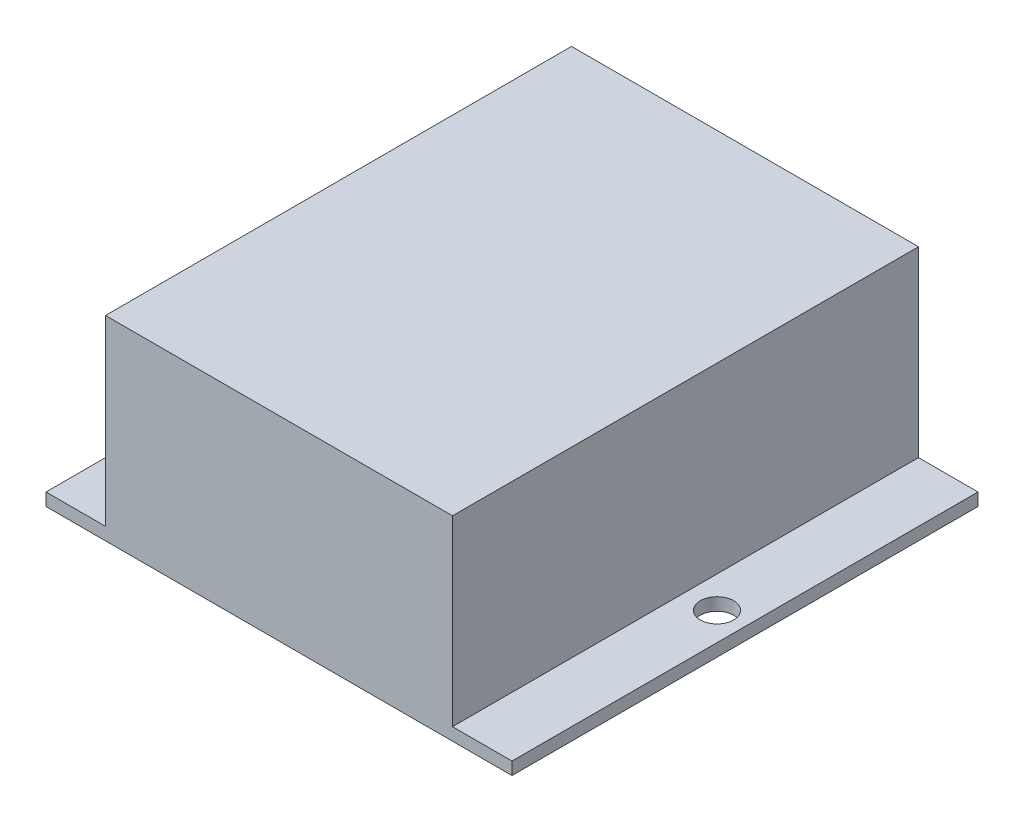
ISO-10303-21;
HEADER;
FILE_DESCRIPTION(('STEP AP214'),'2;1');
FILE_NAME('part.step','',(''),(''),'','','');
FILE_SCHEMA(('AUTOMOTIVE_DESIGN { 1 0 10303 214 1 1 1 1 }'));
ENDSEC;
DATA;
#1=APPLICATION_CONTEXT('core data for automotive mechanical design processes');
#2=APPLICATION_PROTOCOL_DEFINITION('international standard','automotive_design',2000,#1);
#3=PRODUCT_CONTEXT('',#1,'mechanical');
#4=PRODUCT('Part','Part','',(#3));
#5=PRODUCT_RELATED_PRODUCT_CATEGORY('part','',(#4));
#6=PRODUCT_DEFINITION_FORMATION('','',#4);
#7=PRODUCT_DEFINITION_CONTEXT('part definition',#1,'design');
#8=PRODUCT_DEFINITION('design','',#6,#7);
#9=PRODUCT_DEFINITION_SHAPE('','',#8);
#10=(LENGTH_UNIT() NAMED_UNIT(*) SI_UNIT(.MILLI.,.METRE.));
#11=(NAMED_UNIT(*) PLANE_ANGLE_UNIT() SI_UNIT($,.RADIAN.));
#12=(NAMED_UNIT(*) SI_UNIT($,.STERADIAN.) SOLID_ANGLE_UNIT());
#13=UNCERTAINTY_MEASURE_WITH_UNIT(LENGTH_MEASURE(1.E-05),#10,'distance_accuracy_value','');
#14=(GEOMETRIC_REPRESENTATION_CONTEXT(3) GLOBAL_UNCERTAINTY_ASSIGNED_CONTEXT((#13)) GLOBAL_UNIT_ASSIGNED_CONTEXT((#10,
#11,#12)) REPRESENTATION_CONTEXT('',''));
#15=CARTESIAN_POINT('',(0.,0.,0.));
#16=DIRECTION('',(0.,0.,1.));
#17=DIRECTION('',(1.,0.,0.));
#18=AXIS2_PLACEMENT_3D('',#15,#16,#17);
#19=CARTESIAN_POINT('',(0.,2.,0.));
#20=DIRECTION('',(0.,1.,0.));
#21=DIRECTION('',(1.,0.,0.));
#22=AXIS2_PLACEMENT_3D('',#19,#20,#21);
#23=PLANE('',#22);
#24=CARTESIAN_POINT('',(32.55,2.,0.));
#25=DIRECTION('',(0.,1.,0.));
#26=DIRECTION('',(0.,0.,1.));
#27=AXIS2_PLACEMENT_3D('',#24,#25,#26);
#28=CIRCLE('',#27,2.65);
#29=CARTESIAN_POINT('',(32.55,2.,2.64999999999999));
#30=VERTEX_POINT('',#29);
#31=EDGE_CURVE('E137',#30,#30,#28,.T.);
#32=ORIENTED_EDGE('',*,*,#31,.F.);
#33=EDGE_LOOP('',(#32));
#34=FACE_BOUND('',#33,.T.);
#35=DIRECTION('',(0.,0.,-1.));
#36=VECTOR('',#35,1.);
#37=CARTESIAN_POINT('',(27.55,2.,0.));
#38=LINE('',#37,#36);
#39=CARTESIAN_POINT('',(27.55,2.,37.));
#40=VERTEX_POINT('',#39);
#41=CARTESIAN_POINT('',(27.55,2.,-37.));
#42=VERTEX_POINT('',#41);
#43=EDGE_CURVE('E47',#40,#42,#38,.T.);
#44=ORIENTED_EDGE('',*,*,#43,.F.);
#45=DIRECTION('',(1.,0.,0.));
#46=VECTOR('',#45,1.);
#47=CARTESIAN_POINT('',(0.,2.,37.));
#48=LINE('',#47,#46);
#49=CARTESIAN_POINT('',(37.,2.,37.));
#50=VERTEX_POINT('',#49);
#51=EDGE_CURVE('E127',#40,#50,#48,.T.);
#52=ORIENTED_EDGE('',*,*,#51,.T.);
#53=DIRECTION('',(0.,0.,-1.));
#54=VECTOR('',#53,1.);
#55=CARTESIAN_POINT('',(37.,2.,0.));
#56=LINE('',#55,#54);
#57=CARTESIAN_POINT('',(37.,2.,-37.));
#58=VERTEX_POINT('',#57);
#59=EDGE_CURVE('E11',#50,#58,#56,.T.);
#60=ORIENTED_EDGE('',*,*,#59,.T.);
#61=DIRECTION('',(1.,0.,0.));
#62=VECTOR('',#61,1.);
#63=CARTESIAN_POINT('',(0.,2.,-37.));
#64=LINE('',#63,#62);
#65=EDGE_CURVE('E190',#42,#58,#64,.T.);
#66=ORIENTED_EDGE('',*,*,#65,.F.);
#67=EDGE_LOOP('',(#44,#52,#60,#66));
#68=FACE_BOUND('',#67,.T.);
#69=ADVANCED_FACE('F17',(#34,#68),#23,.T.);
#70=CARTESIAN_POINT('',(37.,2.,0.));
#71=DIRECTION('',(-1.,0.,0.));
#72=DIRECTION('',(0.,0.,1.));
#73=AXIS2_PLACEMENT_3D('',#70,#71,#72);
#74=PLANE('',#73);
#75=DIRECTION('',(0.,0.,-1.));
#76=VECTOR('',#75,1.);
#77=CARTESIAN_POINT('',(37.,0.,0.));
#78=LINE('',#77,#76);
#79=CARTESIAN_POINT('',(37.,0.,37.));
#80=VERTEX_POINT('',#79);
#81=CARTESIAN_POINT('',(37.,0.,-37.));
#82=VERTEX_POINT('',#81);
#83=EDGE_CURVE('E207',#80,#82,#78,.T.);
#84=ORIENTED_EDGE('',*,*,#83,.T.);
#85=DIRECTION('',(0.,-1.,0.));
#86=VECTOR('',#85,1.);
#87=CARTESIAN_POINT('',(37.,2.,-37.));
#88=LINE('',#87,#86);
#89=EDGE_CURVE('E194',#58,#82,#88,.T.);
#90=ORIENTED_EDGE('',*,*,#89,.F.);
#91=ORIENTED_EDGE('',*,*,#59,.F.);
#92=DIRECTION('',(0.,-1.,0.));
#93=VECTOR('',#92,1.);
#94=CARTESIAN_POINT('',(37.,2.,37.));
#95=LINE('',#94,#93);
#96=EDGE_CURVE('E134',#50,#80,#95,.T.);
#97=ORIENTED_EDGE('',*,*,#96,.T.);
#98=EDGE_LOOP('',(#84,#90,#91,#97));
#99=FACE_BOUND('',#98,.T.);
#100=ADVANCED_FACE('F230',(#99),#74,.F.);
#101=CARTESIAN_POINT('',(0.,31.,0.));
#102=DIRECTION('',(0.,1.,0.));
#103=DIRECTION('',(1.,0.,0.));
#104=AXIS2_PLACEMENT_3D('',#101,#102,#103);
#105=PLANE('',#104);
#106=DIRECTION('',(1.,0.,0.));
#107=VECTOR('',#106,1.);
#108=CARTESIAN_POINT('',(0.,31.,37.));
#109=LINE('',#108,#107);
#110=CARTESIAN_POINT('',(-27.55,31.,37.));
#111=VERTEX_POINT('',#110);
#112=CARTESIAN_POINT('',(27.55,31.,37.));
#113=VERTEX_POINT('',#112);
#114=EDGE_CURVE('E115',#111,#113,#109,.T.);
#115=ORIENTED_EDGE('',*,*,#114,.T.);
#116=DIRECTION('',(0.,0.,-1.));
#117=VECTOR('',#116,1.);
#118=CARTESIAN_POINT('',(27.55,31.,0.));
#119=LINE('',#118,#117);
#120=CARTESIAN_POINT('',(27.55,31.,-37.));
#121=VERTEX_POINT('',#120);
#122=EDGE_CURVE('E25',#113,#121,#119,.T.);
#123=ORIENTED_EDGE('',*,*,#122,.T.);
#124=DIRECTION('',(1.,0.,0.));
#125=VECTOR('',#124,1.);
#126=CARTESIAN_POINT('',(0.,31.,-37.));
#127=LINE('',#126,#125);
#128=CARTESIAN_POINT('',(-27.55,31.,-37.));
#129=VERTEX_POINT('',#128);
#130=EDGE_CURVE('E185',#129,#121,#127,.T.);
#131=ORIENTED_EDGE('',*,*,#130,.F.);
#132=DIRECTION('',(0.,0.,-1.));
#133=VECTOR('',#132,1.);
#134=CARTESIAN_POINT('',(-27.55,31.,0.));
#135=LINE('',#134,#133);
#136=EDGE_CURVE('E117',#111,#129,#135,.T.);
#137=ORIENTED_EDGE('',*,*,#136,.F.);
#138=EDGE_LOOP('',(#115,#123,#131,#137));
#139=FACE_BOUND('',#138,.T.);
#140=ADVANCED_FACE('F116',(#139),#105,.T.);
#141=CARTESIAN_POINT('',(27.55,31.,0.));
#142=DIRECTION('',(-1.,0.,0.));
#143=DIRECTION('',(0.,0.,1.));
#144=AXIS2_PLACEMENT_3D('',#141,#142,#143);
#145=PLANE('',#144);
#146=DIRECTION('',(0.,-1.,0.));
#147=VECTOR('',#146,1.);
#148=CARTESIAN_POINT('',(27.55,31.,37.));
#149=LINE('',#148,#147);
#150=EDGE_CURVE('E106',#113,#40,#149,.T.);
#151=ORIENTED_EDGE('',*,*,#150,.T.);
#152=ORIENTED_EDGE('',*,*,#43,.T.);
#153=DIRECTION('',(0.,-1.,0.));
#154=VECTOR('',#153,1.);
#155=CARTESIAN_POINT('',(27.55,31.,-37.));
#156=LINE('',#155,#154);
#157=EDGE_CURVE('E109',#121,#42,#156,.T.);
#158=ORIENTED_EDGE('',*,*,#157,.F.);
#159=ORIENTED_EDGE('',*,*,#122,.F.);
#160=EDGE_LOOP('',(#151,#152,#158,#159));
#161=FACE_BOUND('',#160,.T.);
#162=ADVANCED_FACE('F104',(#161),#145,.F.);
#163=CARTESIAN_POINT('',(-27.55,31.,0.));
#164=DIRECTION('',(-1.,0.,0.));
#165=DIRECTION('',(0.,1.,0.));
#166=AXIS2_PLACEMENT_3D('',#163,#164,#165);
#167=PLANE('',#166);
#168=DIRECTION('',(0.,0.,-1.));
#169=VECTOR('',#168,1.);
#170=CARTESIAN_POINT('',(-27.55,2.,0.));
#171=LINE('',#170,#169);
#172=CARTESIAN_POINT('',(-27.55,2.,37.));
#173=VERTEX_POINT('',#172);
#174=CARTESIAN_POINT('',(-27.55,2.,-37.));
#175=VERTEX_POINT('',#174);
#176=EDGE_CURVE('E204',#173,#175,#171,.T.);
#177=ORIENTED_EDGE('',*,*,#176,.F.);
#178=DIRECTION('',(0.,-1.,0.));
#179=VECTOR('',#178,1.);
#180=CARTESIAN_POINT('',(-27.55,31.,37.));
#181=LINE('',#180,#179);
#182=EDGE_CURVE('E122',#111,#173,#181,.T.);
#183=ORIENTED_EDGE('',*,*,#182,.F.);
#184=ORIENTED_EDGE('',*,*,#136,.T.);
#185=DIRECTION('',(0.,-1.,0.));
#186=VECTOR('',#185,1.);
#187=CARTESIAN_POINT('',(-27.55,31.,-37.));
#188=LINE('',#187,#186);
#189=EDGE_CURVE('E181',#129,#175,#188,.T.);
#190=ORIENTED_EDGE('',*,*,#189,.T.);
#191=EDGE_LOOP('',(#177,#183,#184,#190));
#192=FACE_BOUND('',#191,.T.);
#193=ADVANCED_FACE('F214',(#192),#167,.T.);
#194=CARTESIAN_POINT('',(0.,0.,0.));
#195=DIRECTION('',(0.,1.,0.));
#196=DIRECTION('',(1.,0.,0.));
#197=AXIS2_PLACEMENT_3D('',#194,#195,#196);
#198=PLANE('',#197);
#199=CARTESIAN_POINT('',(32.55,0.,0.));
#200=DIRECTION('',(0.,1.,0.));
#201=DIRECTION('',(0.,0.,1.));
#202=AXIS2_PLACEMENT_3D('',#199,#200,#201);
#203=CIRCLE('',#202,2.65);
#204=CARTESIAN_POINT('',(32.55,0.,2.64999999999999));
#205=VERTEX_POINT('',#204);
#206=EDGE_CURVE('E139',#205,#205,#203,.T.);
#207=ORIENTED_EDGE('',*,*,#206,.T.);
#208=EDGE_LOOP('',(#207));
#209=FACE_BOUND('',#208,.T.);
#210=CARTESIAN_POINT('',(-32.55,0.,0.));
#211=DIRECTION('',(0.,1.,0.));
#212=DIRECTION('',(0.,0.,1.));
#213=AXIS2_PLACEMENT_3D('',#210,#211,#212);
#214=CIRCLE('',#213,2.65);
#215=CARTESIAN_POINT('',(-32.55,0.,2.65));
#216=VERTEX_POINT('',#215);
#217=EDGE_CURVE('E147',#216,#216,#214,.T.);
#218=ORIENTED_EDGE('',*,*,#217,.T.);
#219=EDGE_LOOP('',(#218));
#220=FACE_BOUND('',#219,.T.);
#221=DIRECTION('',(1.,0.,0.));
#222=VECTOR('',#221,1.);
#223=CARTESIAN_POINT('',(0.,0.,37.));
#224=LINE('',#223,#222);
#225=CARTESIAN_POINT('',(-37.,0.,37.));
#226=VERTEX_POINT('',#225);
#227=EDGE_CURVE('E148',#226,#80,#224,.T.);
#228=ORIENTED_EDGE('',*,*,#227,.F.);
#229=DIRECTION('',(0.,0.,-1.));
#230=VECTOR('',#229,1.);
#231=CARTESIAN_POINT('',(-37.,0.,0.));
#232=LINE('',#231,#230);
#233=CARTESIAN_POINT('',(-37.,0.,-37.));
#234=VERTEX_POINT('',#233);
#235=EDGE_CURVE('E198',#226,#234,#232,.T.);
#236=ORIENTED_EDGE('',*,*,#235,.T.);
#237=DIRECTION('',(1.,0.,0.));
#238=VECTOR('',#237,1.);
#239=CARTESIAN_POINT('',(0.,0.,-37.));
#240=LINE('',#239,#238);
#241=EDGE_CURVE('E155',#234,#82,#240,.T.);
#242=ORIENTED_EDGE('',*,*,#241,.T.);
#243=ORIENTED_EDGE('',*,*,#83,.F.);
#244=EDGE_LOOP('',(#228,#236,#242,#243));
#245=FACE_BOUND('',#244,.T.);
#246=ADVANCED_FACE('F228',(#209,#220,#245),#198,.F.);
#247=CARTESIAN_POINT('',(0.,2.,0.));
#248=DIRECTION('',(0.,1.,0.));
#249=DIRECTION('',(1.,0.,0.));
#250=AXIS2_PLACEMENT_3D('',#247,#248,#249);
#251=PLANE('',#250);
#252=CARTESIAN_POINT('',(-32.55,2.,0.));
#253=DIRECTION('',(0.,1.,0.));
#254=DIRECTION('',(0.,0.,1.));
#255=AXIS2_PLACEMENT_3D('',#252,#253,#254);
#256=CIRCLE('',#255,2.65);
#257=CARTESIAN_POINT('',(-32.55,2.,2.65));
#258=VERTEX_POINT('',#257);
#259=EDGE_CURVE('E143',#258,#258,#256,.T.);
#260=ORIENTED_EDGE('',*,*,#259,.F.);
#261=EDGE_LOOP('',(#260));
#262=FACE_BOUND('',#261,.T.);
#263=DIRECTION('',(1.,0.,0.));
#264=VECTOR('',#263,1.);
#265=CARTESIAN_POINT('',(0.,2.,37.));
#266=LINE('',#265,#264);
#267=CARTESIAN_POINT('',(-37.,2.,37.));
#268=VERTEX_POINT('',#267);
#269=EDGE_CURVE('E156',#268,#173,#266,.T.);
#270=ORIENTED_EDGE('',*,*,#269,.T.);
#271=ORIENTED_EDGE('',*,*,#176,.T.);
#272=DIRECTION('',(1.,0.,0.));
#273=VECTOR('',#272,1.);
#274=CARTESIAN_POINT('',(0.,2.,-37.));
#275=LINE('',#274,#273);
#276=CARTESIAN_POINT('',(-37.,2.,-37.));
#277=VERTEX_POINT('',#276);
#278=EDGE_CURVE('E177',#277,#175,#275,.T.);
#279=ORIENTED_EDGE('',*,*,#278,.F.);
#280=DIRECTION('',(0.,0.,-1.));
#281=VECTOR('',#280,1.);
#282=CARTESIAN_POINT('',(-37.,2.,0.));
#283=LINE('',#282,#281);
#284=EDGE_CURVE('E201',#268,#277,#283,.T.);
#285=ORIENTED_EDGE('',*,*,#284,.F.);
#286=EDGE_LOOP('',(#270,#271,#279,#285));
#287=FACE_BOUND('',#286,.T.);
#288=ADVANCED_FACE('F222',(#262,#287),#251,.T.);
#289=CARTESIAN_POINT('',(-37.,2.,0.));
#290=DIRECTION('',(-1.,0.,0.));
#291=DIRECTION('',(0.,0.,1.));
#292=AXIS2_PLACEMENT_3D('',#289,#290,#291);
#293=PLANE('',#292);
#294=ORIENTED_EDGE('',*,*,#235,.F.);
#295=DIRECTION('',(0.,-1.,0.));
#296=VECTOR('',#295,1.);
#297=CARTESIAN_POINT('',(-37.,2.,37.));
#298=LINE('',#297,#296);
#299=EDGE_CURVE('E151',#268,#226,#298,.T.);
#300=ORIENTED_EDGE('',*,*,#299,.F.);
#301=ORIENTED_EDGE('',*,*,#284,.T.);
#302=DIRECTION('',(0.,-1.,0.));
#303=VECTOR('',#302,1.);
#304=CARTESIAN_POINT('',(-37.,2.,-37.));
#305=LINE('',#304,#303);
#306=EDGE_CURVE('E173',#277,#234,#305,.T.);
#307=ORIENTED_EDGE('',*,*,#306,.T.);
#308=EDGE_LOOP('',(#294,#300,#301,#307));
#309=FACE_BOUND('',#308,.T.);
#310=ADVANCED_FACE('F424',(#309),#293,.T.);
#311=CARTESIAN_POINT('',(0.,2.,-37.));
#312=DIRECTION('',(0.,0.,-1.));
#313=DIRECTION('',(0.,-1.,0.));
#314=AXIS2_PLACEMENT_3D('',#311,#312,#313);
#315=PLANE('',#314);
#316=ORIENTED_EDGE('',*,*,#241,.F.);
#317=ORIENTED_EDGE('',*,*,#306,.F.);
#318=ORIENTED_EDGE('',*,*,#278,.T.);
#319=ORIENTED_EDGE('',*,*,#189,.F.);
#320=ORIENTED_EDGE('',*,*,#130,.T.);
#321=ORIENTED_EDGE('',*,*,#157,.T.);
#322=ORIENTED_EDGE('',*,*,#65,.T.);
#323=ORIENTED_EDGE('',*,*,#89,.T.);
#324=EDGE_LOOP('',(#316,#317,#318,#319,#320,#321,#322,#323));
#325=FACE_BOUND('',#324,.T.);
#326=ADVANCED_FACE('F218',(#325),#315,.T.);
#327=CARTESIAN_POINT('',(0.,2.,37.));
#328=DIRECTION('',(0.,0.,-1.));
#329=DIRECTION('',(0.,-1.,0.));
#330=AXIS2_PLACEMENT_3D('',#327,#328,#329);
#331=PLANE('',#330);
#332=ORIENTED_EDGE('',*,*,#227,.T.);
#333=ORIENTED_EDGE('',*,*,#96,.F.);
#334=ORIENTED_EDGE('',*,*,#51,.F.);
#335=ORIENTED_EDGE('',*,*,#150,.F.);
#336=ORIENTED_EDGE('',*,*,#114,.F.);
#337=ORIENTED_EDGE('',*,*,#182,.T.);
#338=ORIENTED_EDGE('',*,*,#269,.F.);
#339=ORIENTED_EDGE('',*,*,#299,.T.);
#340=EDGE_LOOP('',(#332,#333,#334,#335,#336,#337,#338,#339));
#341=FACE_BOUND('',#340,.T.);
#342=ADVANCED_FACE('F125',(#341),#331,.F.);
#343=CARTESIAN_POINT('',(-32.55,2.,0.));
#344=DIRECTION('',(0.,-1.,0.));
#345=DIRECTION('',(0.,0.,-1.));
#346=AXIS2_PLACEMENT_3D('',#343,#344,#345);
#347=CYLINDRICAL_SURFACE('',#346,2.65);
#348=ORIENTED_EDGE('',*,*,#217,.F.);
#349=EDGE_LOOP('',(#348));
#350=FACE_BOUND('',#349,.T.);
#351=ORIENTED_EDGE('',*,*,#259,.T.);
#352=EDGE_LOOP('',(#351));
#353=FACE_BOUND('',#352,.T.);
#354=ADVANCED_FACE('F267',(#350,#353),#347,.F.);
#355=CARTESIAN_POINT('',(32.55,2.,0.));
#356=DIRECTION('',(0.,-1.,0.));
#357=DIRECTION('',(0.,0.,-1.));
#358=AXIS2_PLACEMENT_3D('',#355,#356,#357);
#359=CYLINDRICAL_SURFACE('',#358,2.65);
#360=ORIENTED_EDGE('',*,*,#206,.F.);
#361=EDGE_LOOP('',(#360));
#362=FACE_BOUND('',#361,.T.);
#363=ORIENTED_EDGE('',*,*,#31,.T.);
#364=EDGE_LOOP('',(#363));
#365=FACE_BOUND('',#364,.T.);
#366=ADVANCED_FACE('F261',(#362,#365),#359,.F.);
#367=CLOSED_SHELL('',(#69,#100,#140,#162,#193,#246,#288,#310,#326,#342,#354,#366));
#368=MANIFOLD_SOLID_BREP('B1',#367);
#369=ADVANCED_BREP_SHAPE_REPRESENTATION('',(#18,#368),#14);
#370=SHAPE_DEFINITION_REPRESENTATION(#9,#369);
ENDSEC;
END-ISO-10303-21;
